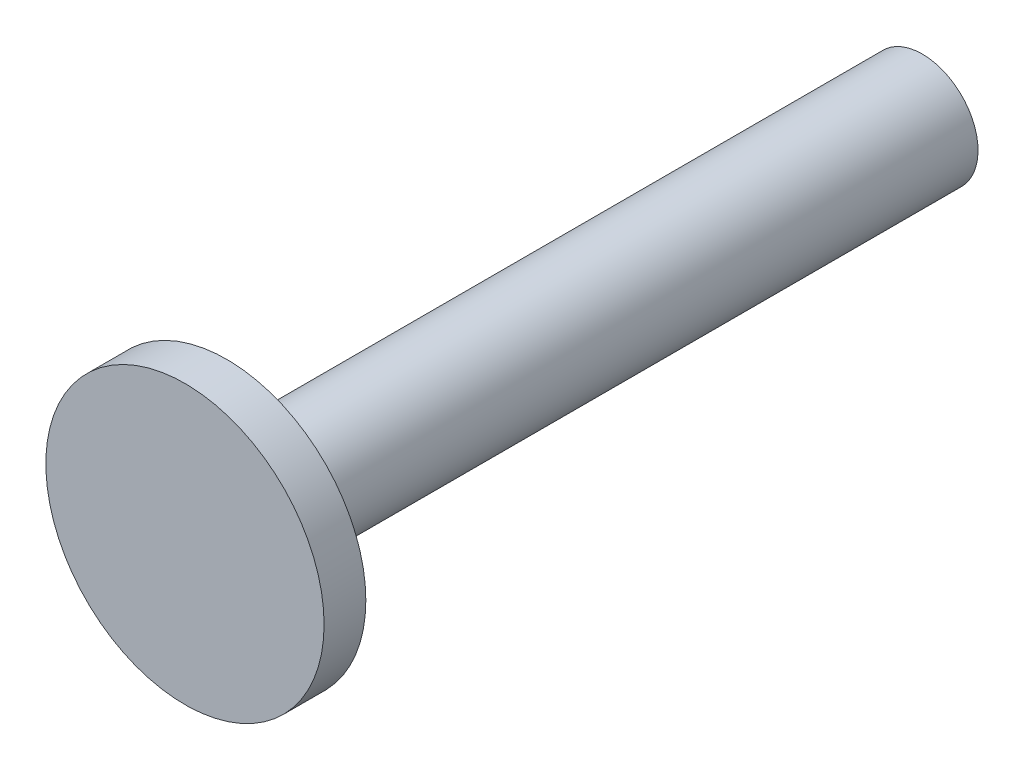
from build123d import *

# Parameters (mm, degrees)
SKETCH1_R           = 10
BOSS_EXTRUDE1_DEPTH = 3
SKETCH2_R           = 4
BOSS_EXTRUDE2_DEPTH = 50


with BuildPart() as part:
    # Sketch1 → Boss-Extrude1 (new body)
    with BuildSketch(Plane.XY):
        with Locations((20, -24.747448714)):
            Circle(SKETCH1_R)
    extrude(amount=BOSS_EXTRUDE1_DEPTH)

    # Sketch2 → Boss-Extrude2 (add)
    with BuildSketch(Plane(origin=(0, 0, 0), x_dir=(-1, 0, 0), z_dir=(0, 0, -1))):
        with Locations(Location((-20, -24.747448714, 0), (0, 0, 90))):
            Circle(SKETCH2_R)
    extrude(amount=BOSS_EXTRUDE2_DEPTH)


solid = part.part
